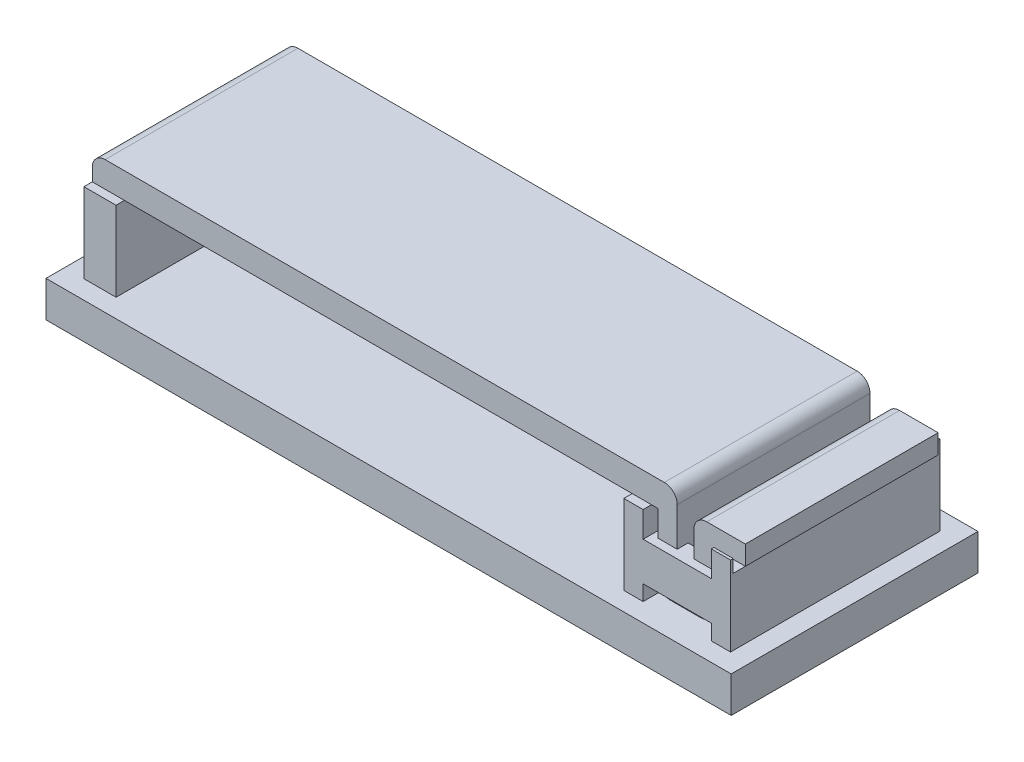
from build123d import *

# Parameters (mm, degrees)
BASE_OUTLINE_W              = 53.3
BASE_OUTLINE_H              = 19.2
CLAMP_BASE_DEPTH            = 2.8
HINGE_AND_LATCH_OUTLINE_W   = 2.5
HINGE_AND_LATCH_OUTLINE_H   = 6.2
HINGE_AND_LATCH_OUTLINE_W_2 = 8.3
CLIP_HINGE_AND_LATCH_DEPTH  = 8.15
LATCH_SIDES_CUT_REACH       = 35.261
SIDE_CUTS_OUTLINE_W         = 5.3
SIDE_CUTS_OUTLINE_H         = 2
SIDE_CUTS_OUTLINE_H_2       = 1.2
LATCH_THROUGH_CUT_REACH     = 31.178
THROUGH_CUT_OUTLINE_W       = 5.3
THROUGH_CUT_OUTLINE_H       = 13.3
LATCH_FRONT_CUT_REACH       = 55.445
FRONT_CUT_OUTLINE_W         = 15.9
FRONT_CUT_OUTLINE_H         = 1
CLAMP_DEPTH                 = 7.5
CLAMP_FILLETS_R             = 1


with BuildPart() as part:
    # Base Outline → Clamp Base (new body)
    with BuildSketch(Plane(origin=(0, 0, 0), x_dir=(1, 0, 0), z_dir=(0, 1, 0))):
        Rectangle(BASE_OUTLINE_W, BASE_OUTLINE_H)
    extrude(amount=CLAMP_BASE_DEPTH)

    # Hinge and Latch Outline → Clip Hinge and Latch (add, symmetric)
    with BuildSketch(Plane.XY):
        with Locations((-23.9, 5.9)):
            Rectangle(HINGE_AND_LATCH_OUTLINE_W, HINGE_AND_LATCH_OUTLINE_H)
        with Locations((21, 5.9)):
            Rectangle(HINGE_AND_LATCH_OUTLINE_W_2, HINGE_AND_LATCH_OUTLINE_H)
    extrude(amount=CLIP_HINGE_AND_LATCH_DEPTH, both=True)

    # Side Cuts Outline → Latch Sides Cut (cut, up to next)
    with BuildSketch(Plane.XY.offset(8.15), mode=Mode.PRIVATE) as latch_sides_cut_sk1:
        with Locations((21, 8)):
            Rectangle(SIDE_CUTS_OUTLINE_W, SIDE_CUTS_OUTLINE_H)
    latch_sides_cut_tool1 = extrude(latch_sides_cut_sk1.sketch, amount=-LATCH_SIDES_CUT_REACH, mode=Mode.PRIVATE) & part.part
    # Side Cuts Outline → Latch Sides Cut (cut, up to next)
    with BuildSketch(Plane.XY.offset(8.15), mode=Mode.PRIVATE) as latch_sides_cut_sk2:
        with Locations((21, 3.4)):
            Rectangle(SIDE_CUTS_OUTLINE_W, SIDE_CUTS_OUTLINE_H_2)
    latch_sides_cut_tool2 = extrude(latch_sides_cut_sk2.sketch, amount=-LATCH_SIDES_CUT_REACH, mode=Mode.PRIVATE) & part.part
    add(latch_sides_cut_tool1.solids().sort_by_distance((21, 8, 8.15))[0], mode=Mode.SUBTRACT)
    add(latch_sides_cut_tool2.solids().sort_by_distance((21, 3.4, 8.15))[0], mode=Mode.SUBTRACT)

    # Through Cut Outline → Latch Through Cut (cut, up to next)
    with BuildSketch(Plane(origin=(0, 7, 0), x_dir=(1, 0, 0), z_dir=(0, 1, 0)), mode=Mode.PRIVATE) as latch_through_cut_sk1:
        with Locations((21, 0)):
            Rectangle(THROUGH_CUT_OUTLINE_W, THROUGH_CUT_OUTLINE_H)
    latch_through_cut_tool1 = extrude(latch_through_cut_sk1.sketch, amount=-LATCH_THROUGH_CUT_REACH, mode=Mode.PRIVATE) & part.part
    add(latch_through_cut_tool1.solids().sort_by_distance((21, 7, 0))[0], mode=Mode.SUBTRACT)

    # Front Cut Outline → Latch Front Cut (cut, up to next)
    with BuildSketch(Plane(origin=(25.15, 0, 0), x_dir=(0, 0, -1), z_dir=(1, 0, 0)), mode=Mode.PRIVATE) as latch_front_cut_sk1:
        with Locations((0, 8.5)):
            Rectangle(FRONT_CUT_OUTLINE_W, FRONT_CUT_OUTLINE_H)
    latch_front_cut_tool1 = extrude(latch_front_cut_sk1.sketch, amount=-LATCH_FRONT_CUT_REACH, mode=Mode.PRIVATE) & part.part
    add(latch_front_cut_tool1.solids().sort_by_distance((25.15, 8.5, 0))[0], mode=Mode.SUBTRACT)

    # Clamp Outline → Clamp (add, symmetric)
    with BuildSketch(Plane.XY):
        Polygon((-25.15, 9), (18.85, 9), (18.85, 3.3), (23.15, 3.3), (23.15, 8.5), (25.65, 8.5), (25.65, 10), (21.65, 10), (21.65, 4.8), (20.35, 4.8), (20.35, 11), (-25.15, 11), align=None)
    extrude(amount=CLAMP_DEPTH, both=True)

    # Clamp Fillets
    clamp_fillets_edges = [part.edges().sort_by_distance(p)[0] for p in [
        (23.15, 8.5, 0),
        (21.65, 10, 0),
        (20.35, 11, 0),
        (-25.15, 11, 0),
        (23.15, 3.3, 0),
        (18.85, 3.3, 0),
    ]]
    fillet(clamp_fillets_edges, radius=CLAMP_FILLETS_R)


solid = part.part
